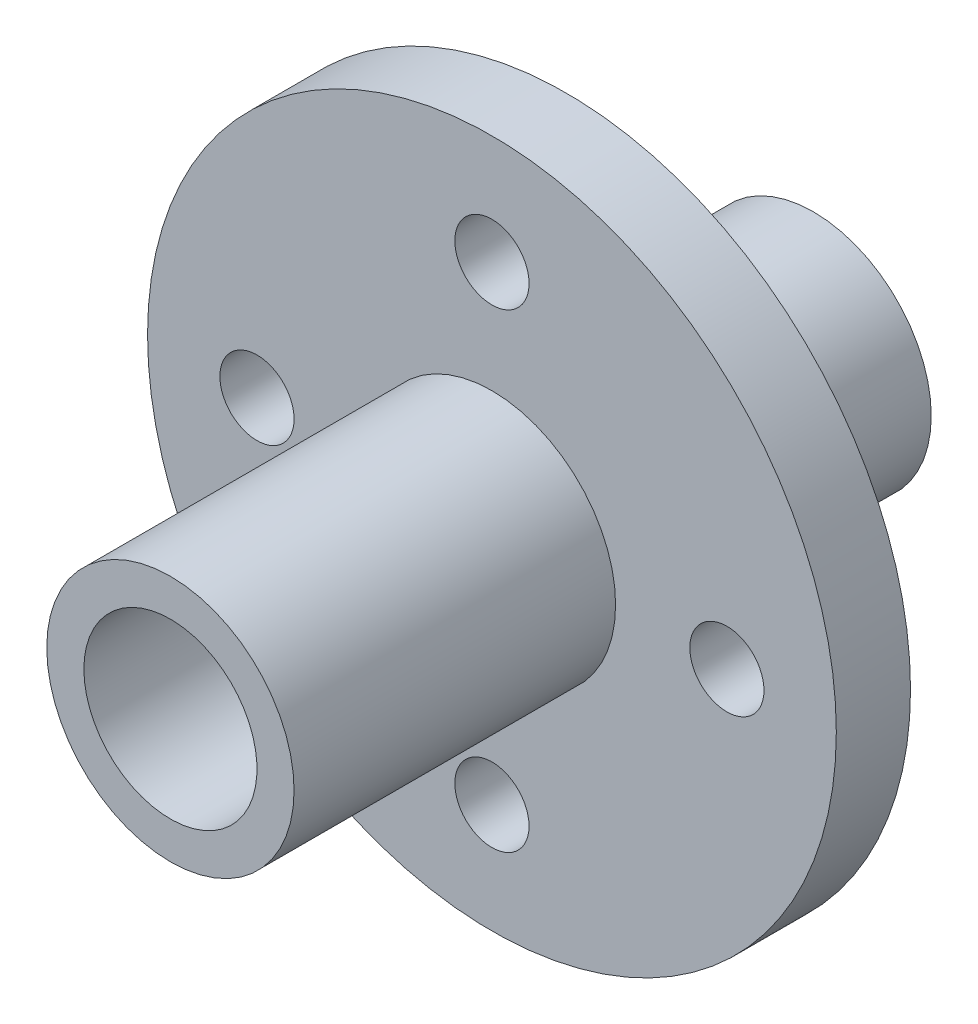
ISO-10303-21;
HEADER;
FILE_DESCRIPTION(('STEP AP214'),'2;1');
FILE_NAME('part.step','',(''),(''),'','','');
FILE_SCHEMA(('AUTOMOTIVE_DESIGN { 1 0 10303 214 1 1 1 1 }'));
ENDSEC;
DATA;
#1=APPLICATION_CONTEXT('core data for automotive mechanical design processes');
#2=APPLICATION_PROTOCOL_DEFINITION('international standard','automotive_design',2000,#1);
#3=PRODUCT_CONTEXT('',#1,'mechanical');
#4=PRODUCT('Part','Part','',(#3));
#5=PRODUCT_RELATED_PRODUCT_CATEGORY('part','',(#4));
#6=PRODUCT_DEFINITION_FORMATION('','',#4);
#7=PRODUCT_DEFINITION_CONTEXT('part definition',#1,'design');
#8=PRODUCT_DEFINITION('design','',#6,#7);
#9=PRODUCT_DEFINITION_SHAPE('','',#8);
#10=(LENGTH_UNIT() NAMED_UNIT(*) SI_UNIT(.MILLI.,.METRE.));
#11=(NAMED_UNIT(*) PLANE_ANGLE_UNIT() SI_UNIT($,.RADIAN.));
#12=(NAMED_UNIT(*) SI_UNIT($,.STERADIAN.) SOLID_ANGLE_UNIT());
#13=UNCERTAINTY_MEASURE_WITH_UNIT(LENGTH_MEASURE(1.E-05),#10,'distance_accuracy_value','');
#14=(GEOMETRIC_REPRESENTATION_CONTEXT(3) GLOBAL_UNCERTAINTY_ASSIGNED_CONTEXT((#13)) GLOBAL_UNIT_ASSIGNED_CONTEXT((#10,
#11,#12)) REPRESENTATION_CONTEXT('',''));
#15=CARTESIAN_POINT('',(0.,0.,0.));
#16=DIRECTION('',(0.,0.,1.));
#17=DIRECTION('',(1.,0.,0.));
#18=AXIS2_PLACEMENT_3D('',#15,#16,#17);
#19=CARTESIAN_POINT('',(0.,0.,3.));
#20=DIRECTION('',(0.,0.,-1.));
#21=DIRECTION('',(-1.,0.,0.));
#22=AXIS2_PLACEMENT_3D('',#19,#20,#21);
#23=CYLINDRICAL_SURFACE('',#22,13.925);
#24=CARTESIAN_POINT('',(0.,0.,3.));
#25=DIRECTION('',(0.,0.,1.));
#26=DIRECTION('',(1.,0.,0.));
#27=AXIS2_PLACEMENT_3D('',#24,#25,#26);
#28=CIRCLE('',#27,13.925);
#29=CARTESIAN_POINT('',(13.925,0.,3.));
#30=VERTEX_POINT('',#29);
#31=EDGE_CURVE('E38',#30,#30,#28,.T.);
#32=ORIENTED_EDGE('',*,*,#31,.F.);
#33=EDGE_LOOP('',(#32));
#34=FACE_BOUND('',#33,.T.);
#35=CARTESIAN_POINT('',(0.,0.,0.));
#36=DIRECTION('',(0.,0.,1.));
#37=DIRECTION('',(1.,0.,0.));
#38=AXIS2_PLACEMENT_3D('',#35,#36,#37);
#39=CIRCLE('',#38,13.925);
#40=CARTESIAN_POINT('',(13.925,0.,0.));
#41=VERTEX_POINT('',#40);
#42=EDGE_CURVE('E43',#41,#41,#39,.T.);
#43=ORIENTED_EDGE('',*,*,#42,.T.);
#44=EDGE_LOOP('',(#43));
#45=FACE_BOUND('',#44,.T.);
#46=ADVANCED_FACE('F31',(#34,#45),#23,.T.);
#47=CARTESIAN_POINT('',(0.,0.,3.));
#48=DIRECTION('',(0.,0.,1.));
#49=DIRECTION('',(1.,0.,0.));
#50=AXIS2_PLACEMENT_3D('',#47,#48,#49);
#51=PLANE('',#50);
#52=CARTESIAN_POINT('',(9.5,0.,3.));
#53=DIRECTION('',(0.,0.,1.));
#54=DIRECTION('',(1.,0.,0.));
#55=AXIS2_PLACEMENT_3D('',#52,#53,#54);
#56=CIRCLE('',#55,1.5);
#57=CARTESIAN_POINT('',(11.,0.,3.));
#58=VERTEX_POINT('',#57);
#59=EDGE_CURVE('E67',#58,#58,#56,.T.);
#60=ORIENTED_EDGE('',*,*,#59,.F.);
#61=EDGE_LOOP('',(#60));
#62=FACE_BOUND('',#61,.T.);
#63=CARTESIAN_POINT('',(0.,-9.5,3.));
#64=DIRECTION('',(0.,0.,1.));
#65=DIRECTION('',(1.,0.,0.));
#66=AXIS2_PLACEMENT_3D('',#63,#64,#65);
#67=CIRCLE('',#66,1.5);
#68=CARTESIAN_POINT('',(1.5,-9.5,3.));
#69=VERTEX_POINT('',#68);
#70=EDGE_CURVE('E56',#69,#69,#67,.T.);
#71=ORIENTED_EDGE('',*,*,#70,.F.);
#72=EDGE_LOOP('',(#71));
#73=FACE_BOUND('',#72,.T.);
#74=CARTESIAN_POINT('',(-9.5,0.,3.));
#75=DIRECTION('',(0.,0.,1.));
#76=DIRECTION('',(1.,0.,0.));
#77=AXIS2_PLACEMENT_3D('',#74,#75,#76);
#78=CIRCLE('',#77,1.5);
#79=CARTESIAN_POINT('',(-8.,0.,3.));
#80=VERTEX_POINT('',#79);
#81=EDGE_CURVE('E53',#80,#80,#78,.T.);
#82=ORIENTED_EDGE('',*,*,#81,.F.);
#83=EDGE_LOOP('',(#82));
#84=FACE_BOUND('',#83,.T.);
#85=CARTESIAN_POINT('',(0.,9.5,3.));
#86=DIRECTION('',(0.,0.,1.));
#87=DIRECTION('',(1.,0.,0.));
#88=AXIS2_PLACEMENT_3D('',#85,#86,#87);
#89=CIRCLE('',#88,1.5);
#90=CARTESIAN_POINT('',(1.5,9.5,3.));
#91=VERTEX_POINT('',#90);
#92=EDGE_CURVE('E50',#91,#91,#89,.T.);
#93=ORIENTED_EDGE('',*,*,#92,.F.);
#94=EDGE_LOOP('',(#93));
#95=FACE_BOUND('',#94,.T.);
#96=CARTESIAN_POINT('',(0.,0.,3.));
#97=DIRECTION('',(0.,0.,1.));
#98=DIRECTION('',(1.,0.,0.));
#99=AXIS2_PLACEMENT_3D('',#96,#97,#98);
#100=CIRCLE('',#99,5.);
#101=CARTESIAN_POINT('',(-5.,0.,3.));
#102=VERTEX_POINT('',#101);
#103=EDGE_CURVE('E79',#102,#102,#100,.T.);
#104=ORIENTED_EDGE('',*,*,#103,.F.);
#105=EDGE_LOOP('',(#104));
#106=FACE_BOUND('',#105,.T.);
#107=ORIENTED_EDGE('',*,*,#31,.T.);
#108=EDGE_LOOP('',(#107));
#109=FACE_BOUND('',#108,.T.);
#110=ADVANCED_FACE('F88',(#62,#73,#84,#95,#106,#109),#51,.T.);
#111=CARTESIAN_POINT('',(0.,0.,0.));
#112=DIRECTION('',(0.,0.,1.));
#113=DIRECTION('',(1.,0.,0.));
#114=AXIS2_PLACEMENT_3D('',#111,#112,#113);
#115=PLANE('',#114);
#116=CARTESIAN_POINT('',(9.5,0.,0.));
#117=DIRECTION('',(0.,0.,1.));
#118=DIRECTION('',(1.,0.,0.));
#119=AXIS2_PLACEMENT_3D('',#116,#117,#118);
#120=CIRCLE('',#119,1.5);
#121=CARTESIAN_POINT('',(11.,0.,0.));
#122=VERTEX_POINT('',#121);
#123=EDGE_CURVE('E34',#122,#122,#120,.T.);
#124=ORIENTED_EDGE('',*,*,#123,.T.);
#125=EDGE_LOOP('',(#124));
#126=FACE_BOUND('',#125,.T.);
#127=CARTESIAN_POINT('',(0.,-9.5,0.));
#128=DIRECTION('',(0.,0.,1.));
#129=DIRECTION('',(1.,0.,0.));
#130=AXIS2_PLACEMENT_3D('',#127,#128,#129);
#131=CIRCLE('',#130,1.5);
#132=CARTESIAN_POINT('',(1.5,-9.5,0.));
#133=VERTEX_POINT('',#132);
#134=EDGE_CURVE('E54',#133,#133,#131,.T.);
#135=ORIENTED_EDGE('',*,*,#134,.T.);
#136=EDGE_LOOP('',(#135));
#137=FACE_BOUND('',#136,.T.);
#138=CARTESIAN_POINT('',(-9.5,0.,0.));
#139=DIRECTION('',(0.,0.,1.));
#140=DIRECTION('',(1.,0.,0.));
#141=AXIS2_PLACEMENT_3D('',#138,#139,#140);
#142=CIRCLE('',#141,1.5);
#143=CARTESIAN_POINT('',(-8.,0.,0.));
#144=VERTEX_POINT('',#143);
#145=EDGE_CURVE('E51',#144,#144,#142,.T.);
#146=ORIENTED_EDGE('',*,*,#145,.T.);
#147=EDGE_LOOP('',(#146));
#148=FACE_BOUND('',#147,.T.);
#149=CARTESIAN_POINT('',(0.,9.5,0.));
#150=DIRECTION('',(0.,0.,1.));
#151=DIRECTION('',(1.,0.,0.));
#152=AXIS2_PLACEMENT_3D('',#149,#150,#151);
#153=CIRCLE('',#152,1.5);
#154=CARTESIAN_POINT('',(1.5,9.5,0.));
#155=VERTEX_POINT('',#154);
#156=EDGE_CURVE('E47',#155,#155,#153,.T.);
#157=ORIENTED_EDGE('',*,*,#156,.T.);
#158=EDGE_LOOP('',(#157));
#159=FACE_BOUND('',#158,.T.);
#160=CARTESIAN_POINT('',(0.,0.,0.));
#161=DIRECTION('',(0.,0.,1.));
#162=DIRECTION('',(1.,0.,0.));
#163=AXIS2_PLACEMENT_3D('',#160,#161,#162);
#164=CIRCLE('',#163,4.7625);
#165=CARTESIAN_POINT('',(4.7625,0.,0.));
#166=VERTEX_POINT('',#165);
#167=EDGE_CURVE('E10',#166,#166,#164,.F.);
#168=ORIENTED_EDGE('',*,*,#167,.F.);
#169=EDGE_LOOP('',(#168));
#170=FACE_BOUND('',#169,.T.);
#171=ORIENTED_EDGE('',*,*,#42,.F.);
#172=EDGE_LOOP('',(#171));
#173=FACE_BOUND('',#172,.T.);
#174=ADVANCED_FACE('F91',(#126,#137,#148,#159,#170,#173),#115,.F.);
#175=CARTESIAN_POINT('',(0.,0.,16.));
#176=DIRECTION('',(0.,0.,1.));
#177=DIRECTION('',(1.,0.,0.));
#178=AXIS2_PLACEMENT_3D('',#175,#176,#177);
#179=PLANE('',#178);
#180=CARTESIAN_POINT('',(0.,0.,16.));
#181=DIRECTION('',(0.,0.,1.));
#182=DIRECTION('',(1.,0.,0.));
#183=AXIS2_PLACEMENT_3D('',#180,#181,#182);
#184=CIRCLE('',#183,5.);
#185=CARTESIAN_POINT('',(-5.,0.,16.));
#186=VERTEX_POINT('',#185);
#187=EDGE_CURVE('E80',#186,#186,#184,.T.);
#188=ORIENTED_EDGE('',*,*,#187,.T.);
#189=EDGE_LOOP('',(#188));
#190=FACE_BOUND('',#189,.T.);
#191=CARTESIAN_POINT('',(0.,0.,16.));
#192=DIRECTION('',(0.,0.,1.));
#193=DIRECTION('',(1.,0.,0.));
#194=AXIS2_PLACEMENT_3D('',#191,#192,#193);
#195=CIRCLE('',#194,3.5);
#196=CARTESIAN_POINT('',(-3.5,0.,16.));
#197=VERTEX_POINT('',#196);
#198=EDGE_CURVE('E76',#197,#197,#195,.T.);
#199=ORIENTED_EDGE('',*,*,#198,.F.);
#200=EDGE_LOOP('',(#199));
#201=FACE_BOUND('',#200,.T.);
#202=ADVANCED_FACE('F102',(#190,#201),#179,.T.);
#203=CARTESIAN_POINT('',(0.,0.,16.));
#204=DIRECTION('',(0.,0.,-1.));
#205=DIRECTION('',(-1.,0.,0.));
#206=AXIS2_PLACEMENT_3D('',#203,#204,#205);
#207=CYLINDRICAL_SURFACE('',#206,5.);
#208=CARTESIAN_POINT('',(-5.,0.,16.));
#209=CARTESIAN_POINT('',(-5.,0.,15.8645833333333));
#210=CARTESIAN_POINT('',(-5.,0.,15.7291666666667));
#211=CARTESIAN_POINT('',(-5.,0.,15.4583333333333));
#212=CARTESIAN_POINT('',(-5.,0.,15.3229166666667));
#213=CARTESIAN_POINT('',(-5.,0.,15.0520833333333));
#214=CARTESIAN_POINT('',(-5.,0.,14.9166666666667));
#215=CARTESIAN_POINT('',(-5.,0.,14.6458333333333));
#216=CARTESIAN_POINT('',(-5.,0.,14.5104166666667));
#217=CARTESIAN_POINT('',(-5.,0.,14.2395833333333));
#218=CARTESIAN_POINT('',(-5.,0.,14.1041666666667));
#219=CARTESIAN_POINT('',(-5.,0.,13.8333333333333));
#220=CARTESIAN_POINT('',(-5.,0.,13.6979166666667));
#221=CARTESIAN_POINT('',(-5.,0.,13.4270833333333));
#222=CARTESIAN_POINT('',(-5.,0.,13.2916666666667));
#223=CARTESIAN_POINT('',(-5.,0.,13.0208333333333));
#224=CARTESIAN_POINT('',(-5.,0.,12.8854166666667));
#225=CARTESIAN_POINT('',(-5.,0.,12.6145833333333));
#226=CARTESIAN_POINT('',(-5.,0.,12.4791666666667));
#227=CARTESIAN_POINT('',(-5.,0.,12.2083333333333));
#228=CARTESIAN_POINT('',(-5.,0.,12.0729166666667));
#229=CARTESIAN_POINT('',(-5.,0.,11.8020833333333));
#230=CARTESIAN_POINT('',(-5.,0.,11.6666666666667));
#231=CARTESIAN_POINT('',(-5.,0.,11.3958333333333));
#232=CARTESIAN_POINT('',(-5.,0.,11.2604166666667));
#233=CARTESIAN_POINT('',(-5.,0.,10.9895833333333));
#234=CARTESIAN_POINT('',(-5.,0.,10.8541666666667));
#235=CARTESIAN_POINT('',(-5.,0.,10.5833333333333));
#236=CARTESIAN_POINT('',(-5.,0.,10.4479166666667));
#237=CARTESIAN_POINT('',(-5.,0.,10.1770833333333));
#238=CARTESIAN_POINT('',(-5.,0.,10.0416666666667));
#239=CARTESIAN_POINT('',(-5.,0.,9.77083333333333));
#240=CARTESIAN_POINT('',(-5.,0.,9.63541666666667));
#241=CARTESIAN_POINT('',(-5.,0.,9.36458333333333));
#242=CARTESIAN_POINT('',(-5.,0.,9.22916666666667));
#243=CARTESIAN_POINT('',(-5.,0.,8.95833333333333));
#244=CARTESIAN_POINT('',(-5.,0.,8.82291666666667));
#245=CARTESIAN_POINT('',(-5.,0.,8.55208333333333));
#246=CARTESIAN_POINT('',(-5.,0.,8.41666666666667));
#247=CARTESIAN_POINT('',(-5.,0.,8.14583333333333));
#248=CARTESIAN_POINT('',(-5.,0.,8.01041666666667));
#249=CARTESIAN_POINT('',(-5.,0.,7.73958333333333));
#250=CARTESIAN_POINT('',(-5.,0.,7.60416666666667));
#251=CARTESIAN_POINT('',(-5.,0.,7.33333333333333));
#252=CARTESIAN_POINT('',(-5.,0.,7.19791666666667));
#253=CARTESIAN_POINT('',(-5.,0.,6.92708333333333));
#254=CARTESIAN_POINT('',(-5.,0.,6.79166666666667));
#255=CARTESIAN_POINT('',(-5.,0.,6.52083333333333));
#256=CARTESIAN_POINT('',(-5.,0.,6.38541666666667));
#257=CARTESIAN_POINT('',(-5.,0.,6.11458333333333));
#258=CARTESIAN_POINT('',(-5.,0.,5.97916666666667));
#259=CARTESIAN_POINT('',(-5.,0.,5.70833333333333));
#260=CARTESIAN_POINT('',(-5.,0.,5.57291666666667));
#261=CARTESIAN_POINT('',(-5.,0.,5.30208333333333));
#262=CARTESIAN_POINT('',(-5.,0.,5.16666666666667));
#263=CARTESIAN_POINT('',(-5.,0.,4.89583333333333));
#264=CARTESIAN_POINT('',(-5.,0.,4.76041666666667));
#265=CARTESIAN_POINT('',(-5.,0.,4.48958333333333));
#266=CARTESIAN_POINT('',(-5.,0.,4.35416666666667));
#267=CARTESIAN_POINT('',(-5.,0.,4.08333333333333));
#268=CARTESIAN_POINT('',(-5.,0.,3.94791666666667));
#269=CARTESIAN_POINT('',(-5.,0.,3.67708333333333));
#270=CARTESIAN_POINT('',(-5.,0.,3.54166666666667));
#271=CARTESIAN_POINT('',(-5.,0.,3.27083333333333));
#272=CARTESIAN_POINT('',(-5.,0.,3.13541666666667));
#273=CARTESIAN_POINT('',(-5.,0.,3.));
#274=B_SPLINE_CURVE_WITH_KNOTS('',3,(#208,#209,#210,#211,#212,#213,#214,#215,#216,#217,#218,
#219,#220,#221,#222,#223,#224,#225,#226,#227,#228,#229,#230,#231,#232,#233,#234,#235,#236,#237,
#238,#239,#240,#241,#242,#243,#244,#245,#246,#247,#248,#249,#250,#251,#252,#253,#254,#255,#256,
#257,#258,#259,#260,#261,#262,#263,#264,#265,#266,#267,#268,#269,#270,#271,#272,#273),
.UNSPECIFIED.,.F.,.F.,(4,2,2,2,2,2,2,2,2,2,2,2,2,2,2,2,2,2,2,2,2,2,2,2,2,2,2,2,2,2,2,2,4),(0.,
0.406250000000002,0.812500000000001,1.21875,1.625,2.03125,2.4375,2.84375,3.25,3.65625,4.0625,
4.46875,4.875,5.28125,5.6875,6.09375,6.5,6.90625,7.3125,7.71875,8.125,8.53125,8.9375,9.34375,
9.75,10.15625,10.5625,10.96875,11.375,11.78125,12.1875,12.59375,13.),.UNSPECIFIED.);
#275=EDGE_CURVE('BSEAM86',#186,#102,#274,.T.);
#276=ORIENTED_EDGE('',*,*,#187,.F.);
#277=ORIENTED_EDGE('',*,*,#103,.T.);
#278=ORIENTED_EDGE('',*,*,#275,.T.);
#279=ORIENTED_EDGE('',*,*,#275,.F.);
#280=EDGE_LOOP('',(#276,#278,#277,#279));
#281=FACE_BOUND('',#280,.T.);
#282=ADVANCED_FACE('F86',(#281),#207,.T.);
#283=CARTESIAN_POINT('',(0.,0.,16.));
#284=DIRECTION('',(0.,0.,-1.));
#285=DIRECTION('',(-1.,0.,0.));
#286=AXIS2_PLACEMENT_3D('',#283,#284,#285);
#287=CYLINDRICAL_SURFACE('',#286,3.5);
#288=CARTESIAN_POINT('',(0.,0.,-10.));
#289=DIRECTION('',(0.,0.,-1.));
#290=DIRECTION('',(-1.,0.,0.));
#291=AXIS2_PLACEMENT_3D('',#288,#289,#290);
#292=CIRCLE('',#291,3.5);
#293=CARTESIAN_POINT('',(-3.5,0.,-10.));
#294=VERTEX_POINT('',#293);
#295=EDGE_CURVE('E70',#294,#294,#292,.T.);
#296=CARTESIAN_POINT('',(-3.5,0.,16.));
#297=CARTESIAN_POINT('',(-3.5,0.,15.7291666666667));
#298=CARTESIAN_POINT('',(-3.5,0.,15.4583333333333));
#299=CARTESIAN_POINT('',(-3.5,0.,14.9166666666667));
#300=CARTESIAN_POINT('',(-3.5,0.,14.6458333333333));
#301=CARTESIAN_POINT('',(-3.5,0.,14.1041666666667));
#302=CARTESIAN_POINT('',(-3.5,0.,13.8333333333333));
#303=CARTESIAN_POINT('',(-3.5,0.,13.2916666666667));
#304=CARTESIAN_POINT('',(-3.5,0.,13.0208333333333));
#305=CARTESIAN_POINT('',(-3.5,0.,12.4791666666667));
#306=CARTESIAN_POINT('',(-3.5,0.,12.2083333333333));
#307=CARTESIAN_POINT('',(-3.5,0.,11.6666666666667));
#308=CARTESIAN_POINT('',(-3.5,0.,11.3958333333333));
#309=CARTESIAN_POINT('',(-3.5,0.,10.8541666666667));
#310=CARTESIAN_POINT('',(-3.5,0.,10.5833333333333));
#311=CARTESIAN_POINT('',(-3.5,0.,10.0416666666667));
#312=CARTESIAN_POINT('',(-3.5,0.,9.77083333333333));
#313=CARTESIAN_POINT('',(-3.5,0.,9.22916666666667));
#314=CARTESIAN_POINT('',(-3.5,0.,8.95833333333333));
#315=CARTESIAN_POINT('',(-3.5,0.,8.41666666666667));
#316=CARTESIAN_POINT('',(-3.5,0.,8.14583333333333));
#317=CARTESIAN_POINT('',(-3.5,0.,7.60416666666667));
#318=CARTESIAN_POINT('',(-3.5,0.,7.33333333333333));
#319=CARTESIAN_POINT('',(-3.5,0.,6.79166666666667));
#320=CARTESIAN_POINT('',(-3.5,0.,6.52083333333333));
#321=CARTESIAN_POINT('',(-3.5,0.,5.97916666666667));
#322=CARTESIAN_POINT('',(-3.5,0.,5.70833333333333));
#323=CARTESIAN_POINT('',(-3.5,0.,5.16666666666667));
#324=CARTESIAN_POINT('',(-3.5,0.,4.89583333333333));
#325=CARTESIAN_POINT('',(-3.5,0.,4.35416666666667));
#326=CARTESIAN_POINT('',(-3.5,0.,4.08333333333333));
#327=CARTESIAN_POINT('',(-3.5,0.,3.54166666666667));
#328=CARTESIAN_POINT('',(-3.5,0.,3.27083333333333));
#329=CARTESIAN_POINT('',(-3.5,0.,2.72916666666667));
#330=CARTESIAN_POINT('',(-3.5,0.,2.45833333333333));
#331=CARTESIAN_POINT('',(-3.5,0.,1.91666666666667));
#332=CARTESIAN_POINT('',(-3.5,0.,1.64583333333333));
#333=CARTESIAN_POINT('',(-3.5,0.,1.10416666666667));
#334=CARTESIAN_POINT('',(-3.5,0.,0.833333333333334));
#335=CARTESIAN_POINT('',(-3.5,0.,0.291666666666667));
#336=CARTESIAN_POINT('',(-3.5,0.,0.0208333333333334));
#337=CARTESIAN_POINT('',(-3.5,0.,-0.520833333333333));
#338=CARTESIAN_POINT('',(-3.5,0.,-0.791666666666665));
#339=CARTESIAN_POINT('',(-3.5,0.,-1.33333333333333));
#340=CARTESIAN_POINT('',(-3.5,0.,-1.60416666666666));
#341=CARTESIAN_POINT('',(-3.5,0.,-2.14583333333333));
#342=CARTESIAN_POINT('',(-3.5,0.,-2.41666666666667));
#343=CARTESIAN_POINT('',(-3.5,0.,-2.95833333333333));
#344=CARTESIAN_POINT('',(-3.5,0.,-3.22916666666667));
#345=CARTESIAN_POINT('',(-3.5,0.,-3.77083333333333));
#346=CARTESIAN_POINT('',(-3.5,0.,-4.04166666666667));
#347=CARTESIAN_POINT('',(-3.5,0.,-4.58333333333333));
#348=CARTESIAN_POINT('',(-3.5,0.,-4.85416666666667));
#349=CARTESIAN_POINT('',(-3.5,0.,-5.39583333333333));
#350=CARTESIAN_POINT('',(-3.5,0.,-5.66666666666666));
#351=CARTESIAN_POINT('',(-3.5,0.,-6.20833333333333));
#352=CARTESIAN_POINT('',(-3.5,0.,-6.47916666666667));
#353=CARTESIAN_POINT('',(-3.5,0.,-7.02083333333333));
#354=CARTESIAN_POINT('',(-3.5,0.,-7.29166666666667));
#355=CARTESIAN_POINT('',(-3.5,0.,-7.83333333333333));
#356=CARTESIAN_POINT('',(-3.5,0.,-8.10416666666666));
#357=CARTESIAN_POINT('',(-3.5,0.,-8.64583333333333));
#358=CARTESIAN_POINT('',(-3.5,0.,-8.91666666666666));
#359=CARTESIAN_POINT('',(-3.5,0.,-9.45833333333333));
#360=CARTESIAN_POINT('',(-3.5,0.,-9.72916666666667));
#361=CARTESIAN_POINT('',(-3.5,0.,-10.));
#362=B_SPLINE_CURVE_WITH_KNOTS('',3,(#296,#297,#298,#299,#300,#301,#302,#303,#304,#305,#306,
#307,#308,#309,#310,#311,#312,#313,#314,#315,#316,#317,#318,#319,#320,#321,#322,#323,#324,#325,
#326,#327,#328,#329,#330,#331,#332,#333,#334,#335,#336,#337,#338,#339,#340,#341,#342,#343,#344,
#345,#346,#347,#348,#349,#350,#351,#352,#353,#354,#355,#356,#357,#358,#359,#360,#361),
.UNSPECIFIED.,.F.,.F.,(4,2,2,2,2,2,2,2,2,2,2,2,2,2,2,2,2,2,2,2,2,2,2,2,2,2,2,2,2,2,2,2,4),(0.,
0.812499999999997,1.625,2.4375,3.25,4.0625,4.875,5.6875,6.5,7.3125,8.125,8.9375,9.75,10.5625,
11.375,12.1875,13.,13.8125,14.625,15.4375,16.25,17.0625,17.875,18.6875,19.5,20.3125,21.125,
21.9375,22.75,23.5625,24.375,25.1875,26.),.UNSPECIFIED.);
#363=EDGE_CURVE('BSEAM112',#197,#294,#362,.T.);
#364=ORIENTED_EDGE('',*,*,#198,.T.);
#365=ORIENTED_EDGE('',*,*,#295,.T.);
#366=ORIENTED_EDGE('',*,*,#363,.T.);
#367=ORIENTED_EDGE('',*,*,#363,.F.);
#368=EDGE_LOOP('',(#364,#366,#365,#367));
#369=FACE_BOUND('',#368,.T.);
#370=ADVANCED_FACE('F112',(#369),#287,.F.);
#371=CARTESIAN_POINT('',(0.,0.,-10.));
#372=DIRECTION('',(0.,0.,-1.));
#373=DIRECTION('',(-1.,0.,0.));
#374=AXIS2_PLACEMENT_3D('',#371,#372,#373);
#375=PLANE('',#374);
#376=CARTESIAN_POINT('',(0.,0.,-10.));
#377=DIRECTION('',(0.,0.,-1.));
#378=DIRECTION('',(-1.,0.,0.));
#379=AXIS2_PLACEMENT_3D('',#376,#377,#378);
#380=CIRCLE('',#379,4.7625);
#381=CARTESIAN_POINT('',(-4.7625,0.,-10.));
#382=VERTEX_POINT('',#381);
#383=EDGE_CURVE('E73',#382,#382,#380,.T.);
#384=ORIENTED_EDGE('',*,*,#383,.T.);
#385=EDGE_LOOP('',(#384));
#386=FACE_BOUND('',#385,.T.);
#387=ORIENTED_EDGE('',*,*,#295,.F.);
#388=EDGE_LOOP('',(#387));
#389=FACE_BOUND('',#388,.T.);
#390=ADVANCED_FACE('F117',(#386,#389),#375,.T.);
#391=CARTESIAN_POINT('',(0.,0.,-10.));
#392=DIRECTION('',(0.,0.,1.));
#393=DIRECTION('',(1.,0.,0.));
#394=AXIS2_PLACEMENT_3D('',#391,#392,#393);
#395=CYLINDRICAL_SURFACE('',#394,4.7625);
#396=ORIENTED_EDGE('',*,*,#383,.F.);
#397=EDGE_LOOP('',(#396));
#398=FACE_BOUND('',#397,.T.);
#399=ORIENTED_EDGE('',*,*,#167,.T.);
#400=EDGE_LOOP('',(#399));
#401=FACE_BOUND('',#400,.T.);
#402=ADVANCED_FACE('F119',(#398,#401),#395,.T.);
#403=CARTESIAN_POINT('',(0.,9.5,16.));
#404=DIRECTION('',(0.,0.,-1.));
#405=DIRECTION('',(-1.,0.,0.));
#406=AXIS2_PLACEMENT_3D('',#403,#404,#405);
#407=CYLINDRICAL_SURFACE('',#406,1.5);
#408=ORIENTED_EDGE('',*,*,#92,.T.);
#409=EDGE_LOOP('',(#408));
#410=FACE_BOUND('',#409,.T.);
#411=ORIENTED_EDGE('',*,*,#156,.F.);
#412=EDGE_LOOP('',(#411));
#413=FACE_BOUND('',#412,.T.);
#414=ADVANCED_FACE('F122',(#410,#413),#407,.F.);
#415=CARTESIAN_POINT('',(-9.5,0.,16.));
#416=DIRECTION('',(0.,0.,-1.));
#417=DIRECTION('',(-1.,0.,0.));
#418=AXIS2_PLACEMENT_3D('',#415,#416,#417);
#419=CYLINDRICAL_SURFACE('',#418,1.5);
#420=ORIENTED_EDGE('',*,*,#81,.T.);
#421=EDGE_LOOP('',(#420));
#422=FACE_BOUND('',#421,.T.);
#423=ORIENTED_EDGE('',*,*,#145,.F.);
#424=EDGE_LOOP('',(#423));
#425=FACE_BOUND('',#424,.T.);
#426=ADVANCED_FACE('F129',(#422,#425),#419,.F.);
#427=CARTESIAN_POINT('',(0.,-9.5,16.));
#428=DIRECTION('',(0.,0.,-1.));
#429=DIRECTION('',(-1.,0.,0.));
#430=AXIS2_PLACEMENT_3D('',#427,#428,#429);
#431=CYLINDRICAL_SURFACE('',#430,1.5);
#432=ORIENTED_EDGE('',*,*,#70,.T.);
#433=EDGE_LOOP('',(#432));
#434=FACE_BOUND('',#433,.T.);
#435=ORIENTED_EDGE('',*,*,#134,.F.);
#436=EDGE_LOOP('',(#435));
#437=FACE_BOUND('',#436,.T.);
#438=ADVANCED_FACE('F133',(#434,#437),#431,.F.);
#439=CARTESIAN_POINT('',(9.5,0.,16.));
#440=DIRECTION('',(0.,0.,-1.));
#441=DIRECTION('',(-1.,0.,0.));
#442=AXIS2_PLACEMENT_3D('',#439,#440,#441);
#443=CYLINDRICAL_SURFACE('',#442,1.5);
#444=ORIENTED_EDGE('',*,*,#59,.T.);
#445=EDGE_LOOP('',(#444));
#446=FACE_BOUND('',#445,.T.);
#447=ORIENTED_EDGE('',*,*,#123,.F.);
#448=EDGE_LOOP('',(#447));
#449=FACE_BOUND('',#448,.T.);
#450=ADVANCED_FACE('F136',(#446,#449),#443,.F.);
#451=CLOSED_SHELL('',(#46,#110,#174,#202,#282,#370,#390,#402,#414,#426,#438,#450));
#452=MANIFOLD_SOLID_BREP('B2',#451);
#453=ADVANCED_BREP_SHAPE_REPRESENTATION('',(#18,#452),#14);
#454=SHAPE_DEFINITION_REPRESENTATION(#9,#453);
ENDSEC;
END-ISO-10303-21;
